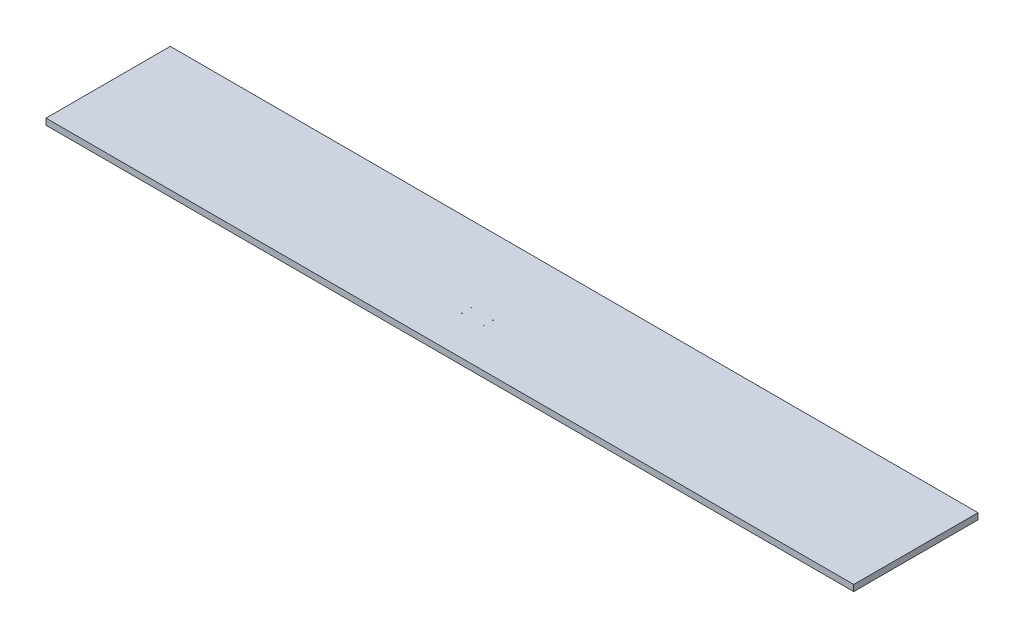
from build123d import *

# Parameters (mm, degrees)
ESQUISSE1_W             = 13000
ESQUISSE1_H             = 2000
BOSS_EXTRU_1_DEPTH      = 100
ESQUISSE2_R             = 5
ENL_V_MAT_EXTRU_1_DEPTH = 6578.233460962


with BuildPart() as part:
    # Esquisse1 → Boss.-Extru.1 (new body)
    with BuildSketch(Plane(origin=(0, 0, 0), x_dir=(1, 0, 0), z_dir=(0, 1, 0))):
        Rectangle(ESQUISSE1_W, ESQUISSE1_H)
    extrude(amount=-BOSS_EXTRU_1_DEPTH)

    # Esquisse2 → Enl_v. mat.-Extru.1 (cut, through all)
    with BuildSketch(Plane(origin=(0, 0, 0), x_dir=(1, 0, 0), z_dir=(0, 1, 0))):
        with Locations(Location((-85, -220, 0), (0, 0, 270))):
            Circle(ESQUISSE2_R)
        with Locations(Location((-85, -370, 0), (0, 0, 270))):
            Circle(ESQUISSE2_R)
        with Locations(Location((-435, -220, 0), (0, 0, 270))):
            Circle(ESQUISSE2_R)
        with Locations(Location((-435, -370, 0), (0, 0, 270))):
            Circle(ESQUISSE2_R)
    extrude(amount=-ENL_V_MAT_EXTRU_1_DEPTH, mode=Mode.SUBTRACT)


solid = part.part
